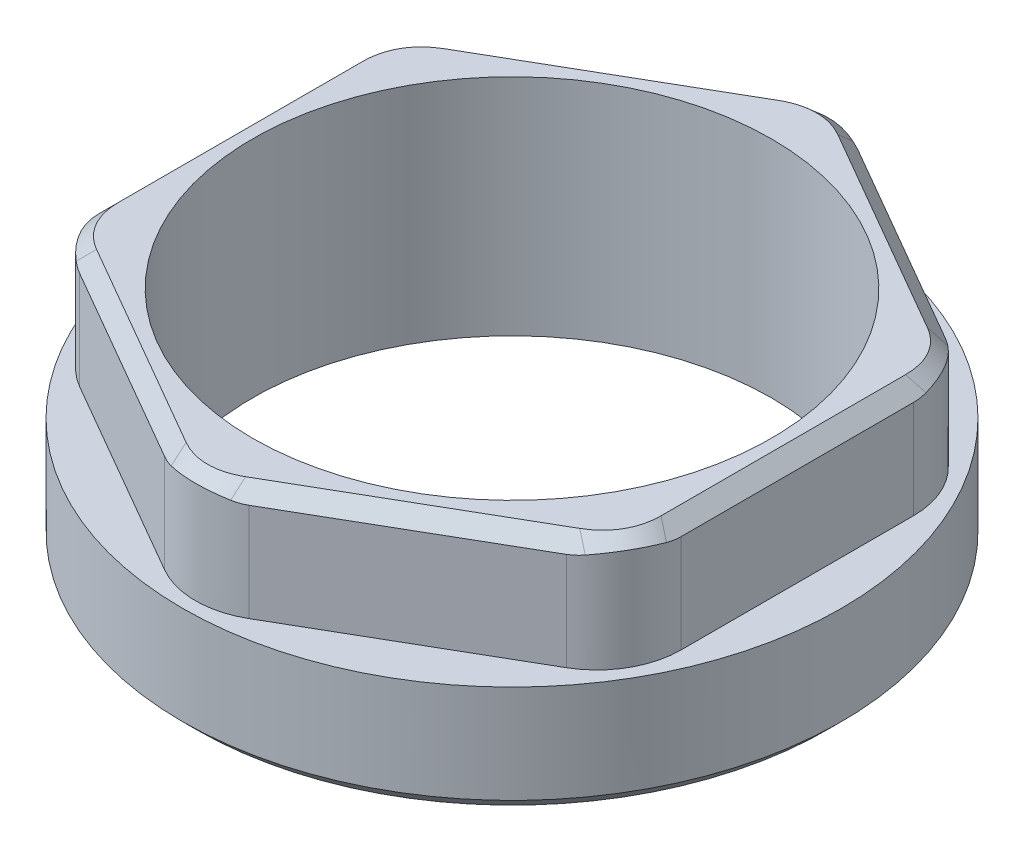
ISO-10303-21;
HEADER;
FILE_DESCRIPTION(('STEP AP214'),'2;1');
FILE_NAME('part.step','',(''),(''),'','','');
FILE_SCHEMA(('AUTOMOTIVE_DESIGN { 1 0 10303 214 1 1 1 1 }'));
ENDSEC;
DATA;
#1=APPLICATION_CONTEXT('core data for automotive mechanical design processes');
#2=APPLICATION_PROTOCOL_DEFINITION('international standard','automotive_design',2000,#1);
#3=PRODUCT_CONTEXT('',#1,'mechanical');
#4=PRODUCT('Part','Part','',(#3));
#5=PRODUCT_RELATED_PRODUCT_CATEGORY('part','',(#4));
#6=PRODUCT_DEFINITION_FORMATION('','',#4);
#7=PRODUCT_DEFINITION_CONTEXT('part definition',#1,'design');
#8=PRODUCT_DEFINITION('design','',#6,#7);
#9=PRODUCT_DEFINITION_SHAPE('','',#8);
#10=(LENGTH_UNIT() NAMED_UNIT(*) SI_UNIT(.MILLI.,.METRE.));
#11=(NAMED_UNIT(*) PLANE_ANGLE_UNIT() SI_UNIT($,.RADIAN.));
#12=(NAMED_UNIT(*) SI_UNIT($,.STERADIAN.) SOLID_ANGLE_UNIT());
#13=UNCERTAINTY_MEASURE_WITH_UNIT(LENGTH_MEASURE(1.E-05),#10,'distance_accuracy_value','');
#14=(GEOMETRIC_REPRESENTATION_CONTEXT(3) GLOBAL_UNCERTAINTY_ASSIGNED_CONTEXT((#13)) GLOBAL_UNIT_ASSIGNED_CONTEXT((#10,
#11,#12)) REPRESENTATION_CONTEXT('',''));
#15=CARTESIAN_POINT('',(0.,0.,0.));
#16=DIRECTION('',(0.,0.,1.));
#17=DIRECTION('',(1.,0.,0.));
#18=AXIS2_PLACEMENT_3D('',#15,#16,#17);
#19=CARTESIAN_POINT('',(0.,4.,0.));
#20=DIRECTION('',(0.,1.,0.));
#21=DIRECTION('',(0.,0.,1.));
#22=AXIS2_PLACEMENT_3D('',#19,#20,#21);
#23=PLANE('',#22);
#24=CARTESIAN_POINT('',(0.,4.,0.));
#25=DIRECTION('',(0.,1.,0.));
#26=DIRECTION('',(0.,0.,1.));
#27=AXIS2_PLACEMENT_3D('',#24,#25,#26);
#28=CIRCLE('',#27,11.75);
#29=CARTESIAN_POINT('',(10.1757984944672,4.,5.87499999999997));
#30=VERTEX_POINT('',#29);
#31=CARTESIAN_POINT('',(10.1757984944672,4.,-5.87499999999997));
#32=VERTEX_POINT('',#31);
#33=EDGE_CURVE('E232',#30,#32,#28,.T.);
#34=ORIENTED_EDGE('',*,*,#33,.T.);
#35=CARTESIAN_POINT('',(0.,4.,-11.75));
#36=VERTEX_POINT('',#35);
#37=EDGE_CURVE('E220',#32,#36,#28,.T.);
#38=ORIENTED_EDGE('',*,*,#37,.T.);
#39=CARTESIAN_POINT('',(-10.1757984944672,4.,-5.87499999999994));
#40=VERTEX_POINT('',#39);
#41=EDGE_CURVE('E215',#36,#40,#28,.T.);
#42=ORIENTED_EDGE('',*,*,#41,.T.);
#43=CARTESIAN_POINT('',(-10.1757984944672,4.,5.87499999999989));
#44=VERTEX_POINT('',#43);
#45=EDGE_CURVE('E219',#40,#44,#28,.T.);
#46=ORIENTED_EDGE('',*,*,#45,.T.);
#47=CARTESIAN_POINT('',(0.,4.,11.75));
#48=VERTEX_POINT('',#47);
#49=EDGE_CURVE('E225',#44,#48,#28,.T.);
#50=ORIENTED_EDGE('',*,*,#49,.T.);
#51=EDGE_CURVE('E227',#48,#30,#28,.T.);
#52=ORIENTED_EDGE('',*,*,#51,.T.);
#53=EDGE_LOOP('',(#34,#38,#42,#46,#50,#52));
#54=FACE_BOUND('',#53,.T.);
#55=DIRECTION('',(0.,0.,-1.));
#56=VECTOR('',#55,1.);
#57=CARTESIAN_POINT('',(10.1757984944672,4.,5.87499999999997));
#58=LINE('',#57,#56);
#59=CARTESIAN_POINT('',(10.1757984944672,4.,4.1429491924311));
#60=VERTEX_POINT('',#59);
#61=CARTESIAN_POINT('',(10.1757984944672,4.,-4.14294919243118));
#62=VERTEX_POINT('',#61);
#63=EDGE_CURVE('E51',#60,#62,#58,.T.);
#64=ORIENTED_EDGE('',*,*,#63,.F.);
#65=CARTESIAN_POINT('',(7.17579849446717,4.,4.1429491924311));
#66=DIRECTION('',(0.,1.,0.));
#67=DIRECTION('',(0.,0.,1.));
#68=AXIS2_PLACEMENT_3D('',#65,#66,#67);
#69=CIRCLE('',#68,3.);
#70=CARTESIAN_POINT('',(8.67579849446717,4.,6.74102540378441));
#71=VERTEX_POINT('',#70);
#72=EDGE_CURVE('E43',#60,#71,#69,.F.);
#73=ORIENTED_EDGE('',*,*,#72,.T.);
#74=DIRECTION('',(0.866025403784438,0.,-0.500000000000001));
#75=VECTOR('',#74,1.);
#76=CARTESIAN_POINT('',(0.,4.,11.75));
#77=LINE('',#76,#75);
#78=CARTESIAN_POINT('',(1.49999999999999,4.,10.8839745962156));
#79=VERTEX_POINT('',#78);
#80=EDGE_CURVE('E58',#79,#71,#77,.T.);
#81=ORIENTED_EDGE('',*,*,#80,.F.);
#82=CARTESIAN_POINT('',(0.,4.,8.28589838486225));
#83=DIRECTION('',(0.,1.,0.));
#84=DIRECTION('',(0.,0.,1.));
#85=AXIS2_PLACEMENT_3D('',#82,#83,#84);
#86=CIRCLE('',#85,3.);
#87=CARTESIAN_POINT('',(-1.49999999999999,4.,10.8839745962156));
#88=VERTEX_POINT('',#87);
#89=EDGE_CURVE('E364',#79,#88,#86,.F.);
#90=ORIENTED_EDGE('',*,*,#89,.T.);
#91=DIRECTION('',(0.866025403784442,0.,0.499999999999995));
#92=VECTOR('',#91,1.);
#93=CARTESIAN_POINT('',(-10.1757984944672,4.,5.87500000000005));
#94=LINE('',#93,#92);
#95=CARTESIAN_POINT('',(-8.6757984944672,4.,6.74102540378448));
#96=VERTEX_POINT('',#95);
#97=EDGE_CURVE('E479',#96,#88,#94,.T.);
#98=ORIENTED_EDGE('',*,*,#97,.F.);
#99=CARTESIAN_POINT('',(-7.17579849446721,4.,4.14294919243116));
#100=DIRECTION('',(0.,1.,0.));
#101=DIRECTION('',(0.,0.,1.));
#102=AXIS2_PLACEMENT_3D('',#99,#100,#101);
#103=CIRCLE('',#102,3.);
#104=CARTESIAN_POINT('',(-10.1757984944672,4.,4.14294919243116));
#105=VERTEX_POINT('',#104);
#106=EDGE_CURVE('E367',#96,#105,#103,.F.);
#107=ORIENTED_EDGE('',*,*,#106,.T.);
#108=DIRECTION('',(0.,0.,1.));
#109=VECTOR('',#108,1.);
#110=CARTESIAN_POINT('',(-10.1757984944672,4.,-5.87499999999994));
#111=LINE('',#110,#109);
#112=CARTESIAN_POINT('',(-10.1757984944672,4.,-4.14294919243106));
#113=VERTEX_POINT('',#112);
#114=EDGE_CURVE('E483',#113,#105,#111,.T.);
#115=ORIENTED_EDGE('',*,*,#114,.F.);
#116=CARTESIAN_POINT('',(-7.17579849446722,4.,-4.14294919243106));
#117=DIRECTION('',(0.,1.,0.));
#118=DIRECTION('',(0.,0.,1.));
#119=AXIS2_PLACEMENT_3D('',#116,#117,#118);
#120=CIRCLE('',#119,3.);
#121=CARTESIAN_POINT('',(-8.67579849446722,4.,-6.74102540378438));
#122=VERTEX_POINT('',#121);
#123=EDGE_CURVE('E370',#113,#122,#120,.F.);
#124=ORIENTED_EDGE('',*,*,#123,.T.);
#125=DIRECTION('',(-0.866025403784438,0.,0.500000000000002));
#126=VECTOR('',#125,1.);
#127=CARTESIAN_POINT('',(0.,4.,-11.75));
#128=LINE('',#127,#126);
#129=CARTESIAN_POINT('',(-1.49999999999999,4.,-10.8839745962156));
#130=VERTEX_POINT('',#129);
#131=EDGE_CURVE('E485',#130,#122,#128,.T.);
#132=ORIENTED_EDGE('',*,*,#131,.F.);
#133=CARTESIAN_POINT('',(0.,4.,-8.28589838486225));
#134=DIRECTION('',(0.,1.,0.));
#135=DIRECTION('',(0.,0.,1.));
#136=AXIS2_PLACEMENT_3D('',#133,#134,#135);
#137=CIRCLE('',#136,3.);
#138=CARTESIAN_POINT('',(1.5,4.,-10.8839745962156));
#139=VERTEX_POINT('',#138);
#140=EDGE_CURVE('E373',#130,#139,#137,.F.);
#141=ORIENTED_EDGE('',*,*,#140,.T.);
#142=DIRECTION('',(-0.866025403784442,0.,-0.499999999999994));
#143=VECTOR('',#142,1.);
#144=CARTESIAN_POINT('',(10.1757984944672,4.,-5.87500000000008));
#145=LINE('',#144,#143);
#146=CARTESIAN_POINT('',(8.67579849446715,4.,-6.74102540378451));
#147=VERTEX_POINT('',#146);
#148=EDGE_CURVE('E487',#147,#139,#145,.T.);
#149=ORIENTED_EDGE('',*,*,#148,.F.);
#150=CARTESIAN_POINT('',(7.17579849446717,4.,-4.14294919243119));
#151=DIRECTION('',(0.,1.,0.));
#152=DIRECTION('',(0.,0.,1.));
#153=AXIS2_PLACEMENT_3D('',#150,#151,#152);
#154=CIRCLE('',#153,3.);
#155=EDGE_CURVE('E11',#147,#62,#154,.F.);
#156=ORIENTED_EDGE('',*,*,#155,.T.);
#157=EDGE_LOOP('',(#64,#73,#81,#90,#98,#107,#115,#124,#132,#141,#149,#156));
#158=FACE_BOUND('',#157,.T.);
#159=ADVANCED_FACE('F34',(#54,#158),#23,.T.);
#160=CARTESIAN_POINT('',(0.,0.,0.));
#161=DIRECTION('',(0.,1.,0.));
#162=DIRECTION('',(0.,0.,1.));
#163=AXIS2_PLACEMENT_3D('',#160,#161,#162);
#164=PLANE('',#163);
#165=CARTESIAN_POINT('',(0.,0.,0.));
#166=DIRECTION('',(0.,1.,0.));
#167=DIRECTION('',(0.,0.,1.));
#168=AXIS2_PLACEMENT_3D('',#165,#166,#167);
#169=CIRCLE('',#168,11.25);
#170=CARTESIAN_POINT('',(0.,0.,11.25));
#171=VERTEX_POINT('',#170);
#172=EDGE_CURVE('E236',#171,#171,#169,.F.);
#173=ORIENTED_EDGE('',*,*,#172,.T.);
#174=EDGE_LOOP('',(#173));
#175=FACE_BOUND('',#174,.T.);
#176=CARTESIAN_POINT('',(0.,0.,0.));
#177=DIRECTION('',(0.,1.,0.));
#178=DIRECTION('',(0.,0.,1.));
#179=AXIS2_PLACEMENT_3D('',#176,#177,#178);
#180=CIRCLE('',#179,9.25);
#181=CARTESIAN_POINT('',(0.,0.,9.25));
#182=VERTEX_POINT('',#181);
#183=EDGE_CURVE('E226',#182,#182,#180,.T.);
#184=ORIENTED_EDGE('',*,*,#183,.T.);
#185=EDGE_LOOP('',(#184));
#186=FACE_BOUND('',#185,.T.);
#187=ADVANCED_FACE('F507',(#175,#186),#164,.F.);
#188=CARTESIAN_POINT('',(0.,4.,0.));
#189=DIRECTION('',(0.,-1.,0.));
#190=DIRECTION('',(0.,0.,-1.));
#191=AXIS2_PLACEMENT_3D('',#188,#189,#190);
#192=CYLINDRICAL_SURFACE('',#191,11.75);
#193=CARTESIAN_POINT('',(0.,0.499999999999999,0.));
#194=DIRECTION('',(0.,1.,0.));
#195=DIRECTION('',(0.,0.,1.));
#196=AXIS2_PLACEMENT_3D('',#193,#194,#195);
#197=CIRCLE('',#196,11.75);
#198=CARTESIAN_POINT('',(0.,0.499999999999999,11.75));
#199=VERTEX_POINT('',#198);
#200=EDGE_CURVE('E231',#199,#199,#197,.T.);
#201=ORIENTED_EDGE('',*,*,#200,.T.);
#202=EDGE_LOOP('',(#201));
#203=FACE_BOUND('',#202,.T.);
#204=ORIENTED_EDGE('',*,*,#51,.F.);
#205=ORIENTED_EDGE('',*,*,#49,.F.);
#206=ORIENTED_EDGE('',*,*,#45,.F.);
#207=ORIENTED_EDGE('',*,*,#41,.F.);
#208=ORIENTED_EDGE('',*,*,#37,.F.);
#209=ORIENTED_EDGE('',*,*,#33,.F.);
#210=EDGE_LOOP('',(#204,#205,#206,#207,#208,#209));
#211=FACE_BOUND('',#210,.T.);
#212=ADVANCED_FACE('F224',(#203,#211),#192,.T.);
#213=CARTESIAN_POINT('',(0.,4.,0.));
#214=DIRECTION('',(0.,-1.,0.));
#215=DIRECTION('',(0.,0.,-1.));
#216=AXIS2_PLACEMENT_3D('',#213,#214,#215);
#217=CYLINDRICAL_SURFACE('',#216,9.25);
#218=ORIENTED_EDGE('',*,*,#183,.F.);
#219=EDGE_LOOP('',(#218));
#220=FACE_BOUND('',#219,.T.);
#221=CARTESIAN_POINT('',(0.,8.,0.));
#222=DIRECTION('',(0.,1.,0.));
#223=DIRECTION('',(0.,0.,1.));
#224=AXIS2_PLACEMENT_3D('',#221,#222,#223);
#225=CIRCLE('',#224,9.25);
#226=CARTESIAN_POINT('',(0.,8.,9.25));
#227=VERTEX_POINT('',#226);
#228=EDGE_CURVE('E380',#227,#227,#225,.T.);
#229=ORIENTED_EDGE('',*,*,#228,.T.);
#230=EDGE_LOOP('',(#229));
#231=FACE_BOUND('',#230,.T.);
#232=ADVANCED_FACE('F492',(#220,#231),#217,.F.);
#233=CARTESIAN_POINT('',(0.,8.,0.));
#234=DIRECTION('',(0.,1.,0.));
#235=DIRECTION('',(0.,0.,1.));
#236=AXIS2_PLACEMENT_3D('',#233,#234,#235);
#237=PLANE('',#236);
#238=DIRECTION('',(0.866025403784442,0.,0.499999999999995));
#239=VECTOR('',#238,1.);
#240=CARTESIAN_POINT('',(0.249999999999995,8.,11.3169872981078));
#241=LINE('',#240,#239);
#242=CARTESIAN_POINT('',(-8.61513832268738,8.,6.19869730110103));
#243=VERTEX_POINT('',#242);
#244=CARTESIAN_POINT('',(-1.06066017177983,8.,10.5602772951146));
#245=VERTEX_POINT('',#244);
#246=EDGE_CURVE('E239',#243,#245,#241,.T.);
#247=ORIENTED_EDGE('',*,*,#246,.T.);
#248=CARTESIAN_POINT('',(0.,8.,6.27367024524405));
#249=DIRECTION('',(0.,1.,0.));
#250=DIRECTION('',(0.,0.,-1.));
#251=AXIS2_PLACEMENT_3D('',#248,#249,#250);
#252=ELLIPSE('',#251,4.58257569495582,3.);
#253=CARTESIAN_POINT('',(1.06066017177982,8.,10.5602772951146));
#254=VERTEX_POINT('',#253);
#255=EDGE_CURVE('E294',#245,#254,#252,.T.);
#256=ORIENTED_EDGE('',*,*,#255,.T.);
#257=DIRECTION('',(0.866025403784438,0.,-0.500000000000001));
#258=VECTOR('',#257,1.);
#259=CARTESIAN_POINT('',(9.92579849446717,8.,5.44198729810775));
#260=LINE('',#259,#258);
#261=CARTESIAN_POINT('',(8.61513832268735,8.,6.19869730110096));
#262=VERTEX_POINT('',#261);
#263=EDGE_CURVE('E242',#254,#262,#260,.T.);
#264=ORIENTED_EDGE('',*,*,#263,.T.);
#265=CARTESIAN_POINT('',(5.4331578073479,8.,3.13683512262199));
#266=DIRECTION('',(0.,1.,0.));
#267=DIRECTION('',(-0.866025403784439,0.,-0.5));
#268=AXIS2_PLACEMENT_3D('',#265,#266,#267);
#269=ELLIPSE('',#268,4.58257569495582,3.);
#270=CARTESIAN_POINT('',(9.67579849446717,8.,4.36157999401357));
#271=VERTEX_POINT('',#270);
#272=EDGE_CURVE('E286',#262,#271,#269,.T.);
#273=ORIENTED_EDGE('',*,*,#272,.T.);
#274=DIRECTION('',(0.,0.,-1.));
#275=VECTOR('',#274,1.);
#276=CARTESIAN_POINT('',(9.67579849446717,8.,-5.87500000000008));
#277=LINE('',#276,#275);
#278=CARTESIAN_POINT('',(9.67579849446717,8.,-4.36157999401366));
#279=VERTEX_POINT('',#278);
#280=EDGE_CURVE('E245',#271,#279,#277,.T.);
#281=ORIENTED_EDGE('',*,*,#280,.T.);
#282=CARTESIAN_POINT('',(5.4331578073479,8.,-3.13683512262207));
#283=DIRECTION('',(0.,1.,0.));
#284=DIRECTION('',(0.866025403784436,0.,-0.500000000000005));
#285=AXIS2_PLACEMENT_3D('',#282,#283,#284);
#286=ELLIPSE('',#285,4.58257569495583,3.);
#287=CARTESIAN_POINT('',(8.61513832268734,8.,-6.19869730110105));
#288=VERTEX_POINT('',#287);
#289=EDGE_CURVE('E284',#279,#288,#286,.T.);
#290=ORIENTED_EDGE('',*,*,#289,.T.);
#291=DIRECTION('',(-0.866025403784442,0.,-0.499999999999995));
#292=VECTOR('',#291,1.);
#293=CARTESIAN_POINT('',(-0.249999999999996,8.,-11.3169872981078));
#294=LINE('',#293,#292);
#295=CARTESIAN_POINT('',(1.06066017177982,8.,-10.5602772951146));
#296=VERTEX_POINT('',#295);
#297=EDGE_CURVE('E248',#288,#296,#294,.T.);
#298=ORIENTED_EDGE('',*,*,#297,.T.);
#299=CARTESIAN_POINT('',(0.,8.,-6.27367024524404));
#300=DIRECTION('',(0.,1.,0.));
#301=DIRECTION('',(0.,0.,-1.));
#302=AXIS2_PLACEMENT_3D('',#299,#300,#301);
#303=ELLIPSE('',#302,4.58257569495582,3.);
#304=CARTESIAN_POINT('',(-1.06066017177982,8.,-10.5602772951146));
#305=VERTEX_POINT('',#304);
#306=EDGE_CURVE('E288',#296,#305,#303,.T.);
#307=ORIENTED_EDGE('',*,*,#306,.T.);
#308=DIRECTION('',(-0.866025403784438,0.,0.500000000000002));
#309=VECTOR('',#308,1.);
#310=CARTESIAN_POINT('',(-9.92579849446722,8.,-5.44198729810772));
#311=LINE('',#310,#309);
#312=CARTESIAN_POINT('',(-8.6151383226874,8.,-6.19869730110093));
#313=VERTEX_POINT('',#312);
#314=EDGE_CURVE('E251',#305,#313,#311,.T.);
#315=ORIENTED_EDGE('',*,*,#314,.T.);
#316=CARTESIAN_POINT('',(-5.43315780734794,8.,-3.13683512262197));
#317=DIRECTION('',(0.,1.,0.));
#318=DIRECTION('',(-0.866025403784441,0.,-0.499999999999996));
#319=AXIS2_PLACEMENT_3D('',#316,#317,#318);
#320=ELLIPSE('',#319,4.58257569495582,3.);
#321=CARTESIAN_POINT('',(-9.67579849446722,8.,-4.36157999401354));
#322=VERTEX_POINT('',#321);
#323=EDGE_CURVE('E290',#313,#322,#320,.T.);
#324=ORIENTED_EDGE('',*,*,#323,.T.);
#325=DIRECTION('',(0.,0.,1.));
#326=VECTOR('',#325,1.);
#327=CARTESIAN_POINT('',(-9.67579849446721,8.,5.87500000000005));
#328=LINE('',#327,#326);
#329=CARTESIAN_POINT('',(-9.67579849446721,8.,4.36157999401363));
#330=VERTEX_POINT('',#329);
#331=EDGE_CURVE('E254',#322,#330,#328,.T.);
#332=ORIENTED_EDGE('',*,*,#331,.T.);
#333=CARTESIAN_POINT('',(-5.43315780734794,8.,3.13683512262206));
#334=DIRECTION('',(0.,1.,0.));
#335=DIRECTION('',(0.866025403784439,0.,-0.5));
#336=AXIS2_PLACEMENT_3D('',#333,#334,#335);
#337=ELLIPSE('',#336,4.58257569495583,3.);
#338=EDGE_CURVE('E292',#330,#243,#337,.T.);
#339=ORIENTED_EDGE('',*,*,#338,.T.);
#340=EDGE_LOOP('',(#247,#256,#264,#273,#281,#290,#298,#307,#315,#324,#332,#339));
#341=FACE_BOUND('',#340,.T.);
#342=ORIENTED_EDGE('',*,*,#228,.F.);
#343=EDGE_LOOP('',(#342));
#344=FACE_BOUND('',#343,.T.);
#345=ADVANCED_FACE('F413',(#341,#344),#237,.T.);
#346=CARTESIAN_POINT('',(10.1757984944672,8.,-5.87500000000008));
#347=DIRECTION('',(-0.499999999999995,0.,0.866025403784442));
#348=DIRECTION('',(0.866025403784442,0.,0.499999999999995));
#349=AXIS2_PLACEMENT_3D('',#346,#347,#348);
#350=PLANE('',#349);
#351=ORIENTED_EDGE('',*,*,#148,.T.);
#352=DIRECTION('',(0.,-1.,0.));
#353=VECTOR('',#352,1.);
#354=CARTESIAN_POINT('',(1.5,8.,-10.8839745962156));
#355=LINE('',#354,#353);
#356=CARTESIAN_POINT('',(1.5,7.5,-10.8839745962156));
#357=VERTEX_POINT('',#356);
#358=EDGE_CURVE('E341',#139,#357,#355,.F.);
#359=ORIENTED_EDGE('',*,*,#358,.T.);
#360=DIRECTION('',(0.866025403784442,0.,0.499999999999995));
#361=VECTOR('',#360,1.);
#362=CARTESIAN_POINT('',(10.1757984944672,7.5,-5.87500000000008));
#363=LINE('',#362,#361);
#364=CARTESIAN_POINT('',(8.67579849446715,7.5,-6.74102540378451));
#365=VERTEX_POINT('',#364);
#366=EDGE_CURVE('E263',#357,#365,#363,.T.);
#367=ORIENTED_EDGE('',*,*,#366,.T.);
#368=DIRECTION('',(0.,-1.,0.));
#369=VECTOR('',#368,1.);
#370=CARTESIAN_POINT('',(8.67579849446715,8.,-6.74102540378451));
#371=LINE('',#370,#369);
#372=EDGE_CURVE('E339',#365,#147,#371,.T.);
#373=ORIENTED_EDGE('',*,*,#372,.T.);
#374=EDGE_LOOP('',(#351,#359,#367,#373));
#375=FACE_BOUND('',#374,.T.);
#376=ADVANCED_FACE('F494',(#375),#350,.F.);
#377=CARTESIAN_POINT('',(0.,8.,-11.75));
#378=DIRECTION('',(0.500000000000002,0.,0.866025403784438));
#379=DIRECTION('',(0.866025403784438,0.,-0.500000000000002));
#380=AXIS2_PLACEMENT_3D('',#377,#378,#379);
#381=PLANE('',#380);
#382=ORIENTED_EDGE('',*,*,#131,.T.);
#383=DIRECTION('',(0.,-1.,0.));
#384=VECTOR('',#383,1.);
#385=CARTESIAN_POINT('',(-8.67579849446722,8.,-6.74102540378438));
#386=LINE('',#385,#384);
#387=CARTESIAN_POINT('',(-8.67579849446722,7.5,-6.74102540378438));
#388=VERTEX_POINT('',#387);
#389=EDGE_CURVE('E329',#122,#388,#386,.F.);
#390=ORIENTED_EDGE('',*,*,#389,.T.);
#391=DIRECTION('',(0.866025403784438,0.,-0.500000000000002));
#392=VECTOR('',#391,1.);
#393=CARTESIAN_POINT('',(0.,7.5,-11.75));
#394=LINE('',#393,#392);
#395=CARTESIAN_POINT('',(-1.49999999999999,7.5,-10.8839745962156));
#396=VERTEX_POINT('',#395);
#397=EDGE_CURVE('E260',#388,#396,#394,.T.);
#398=ORIENTED_EDGE('',*,*,#397,.T.);
#399=DIRECTION('',(0.,-1.,0.));
#400=VECTOR('',#399,1.);
#401=CARTESIAN_POINT('',(-1.49999999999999,8.,-10.8839745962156));
#402=LINE('',#401,#400);
#403=EDGE_CURVE('E326',#396,#130,#402,.T.);
#404=ORIENTED_EDGE('',*,*,#403,.T.);
#405=EDGE_LOOP('',(#382,#390,#398,#404));
#406=FACE_BOUND('',#405,.T.);
#407=ADVANCED_FACE('F500',(#406),#381,.F.);
#408=CARTESIAN_POINT('',(-10.1757984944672,8.,-5.87499999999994));
#409=DIRECTION('',(1.,0.,0.));
#410=DIRECTION('',(0.,0.,-1.));
#411=AXIS2_PLACEMENT_3D('',#408,#409,#410);
#412=PLANE('',#411);
#413=ORIENTED_EDGE('',*,*,#114,.T.);
#414=DIRECTION('',(0.,-1.,0.));
#415=VECTOR('',#414,1.);
#416=CARTESIAN_POINT('',(-10.1757984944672,8.,4.14294919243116));
#417=LINE('',#416,#415);
#418=CARTESIAN_POINT('',(-10.1757984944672,7.5,4.14294919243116));
#419=VERTEX_POINT('',#418);
#420=EDGE_CURVE('E316',#105,#419,#417,.F.);
#421=ORIENTED_EDGE('',*,*,#420,.T.);
#422=DIRECTION('',(0.,0.,-1.));
#423=VECTOR('',#422,1.);
#424=CARTESIAN_POINT('',(-10.1757984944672,7.5,-5.87499999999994));
#425=LINE('',#424,#423);
#426=CARTESIAN_POINT('',(-10.1757984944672,7.5,-4.14294919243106));
#427=VERTEX_POINT('',#426);
#428=EDGE_CURVE('E257',#419,#427,#425,.T.);
#429=ORIENTED_EDGE('',*,*,#428,.T.);
#430=DIRECTION('',(0.,-1.,0.));
#431=VECTOR('',#430,1.);
#432=CARTESIAN_POINT('',(-10.1757984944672,8.,-4.14294919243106));
#433=LINE('',#432,#431);
#434=EDGE_CURVE('E313',#427,#113,#433,.T.);
#435=ORIENTED_EDGE('',*,*,#434,.T.);
#436=EDGE_LOOP('',(#413,#421,#429,#435));
#437=FACE_BOUND('',#436,.T.);
#438=ADVANCED_FACE('F652',(#437),#412,.F.);
#439=CARTESIAN_POINT('',(-10.1757984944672,8.,5.87500000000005));
#440=DIRECTION('',(0.499999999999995,0.,-0.866025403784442));
#441=DIRECTION('',(-0.866025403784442,0.,-0.499999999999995));
#442=AXIS2_PLACEMENT_3D('',#439,#440,#441);
#443=PLANE('',#442);
#444=ORIENTED_EDGE('',*,*,#97,.T.);
#445=DIRECTION('',(0.,-1.,0.));
#446=VECTOR('',#445,1.);
#447=CARTESIAN_POINT('',(-1.49999999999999,8.,10.8839745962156));
#448=LINE('',#447,#446);
#449=CARTESIAN_POINT('',(-1.49999999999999,7.5,10.8839745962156));
#450=VERTEX_POINT('',#449);
#451=EDGE_CURVE('E311',#88,#450,#448,.F.);
#452=ORIENTED_EDGE('',*,*,#451,.T.);
#453=DIRECTION('',(-0.866025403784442,0.,-0.499999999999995));
#454=VECTOR('',#453,1.);
#455=CARTESIAN_POINT('',(-10.1757984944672,7.5,5.87500000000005));
#456=LINE('',#455,#454);
#457=CARTESIAN_POINT('',(-8.6757984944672,7.5,6.74102540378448));
#458=VERTEX_POINT('',#457);
#459=EDGE_CURVE('E272',#450,#458,#456,.T.);
#460=ORIENTED_EDGE('',*,*,#459,.T.);
#461=DIRECTION('',(0.,-1.,0.));
#462=VECTOR('',#461,1.);
#463=CARTESIAN_POINT('',(-8.6757984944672,8.,6.74102540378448));
#464=LINE('',#463,#462);
#465=EDGE_CURVE('E308',#458,#96,#464,.T.);
#466=ORIENTED_EDGE('',*,*,#465,.T.);
#467=EDGE_LOOP('',(#444,#452,#460,#466));
#468=FACE_BOUND('',#467,.T.);
#469=ADVANCED_FACE('F645',(#468),#443,.F.);
#470=CARTESIAN_POINT('',(0.,8.,11.75));
#471=DIRECTION('',(-0.500000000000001,0.,-0.866025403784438));
#472=DIRECTION('',(-0.866025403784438,0.,0.500000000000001));
#473=AXIS2_PLACEMENT_3D('',#470,#471,#472);
#474=PLANE('',#473);
#475=DIRECTION('',(-0.866025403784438,0.,0.500000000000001));
#476=VECTOR('',#475,1.);
#477=CARTESIAN_POINT('',(0.,7.5,11.75));
#478=LINE('',#477,#476);
#479=CARTESIAN_POINT('',(8.67579849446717,7.5,6.74102540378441));
#480=VERTEX_POINT('',#479);
#481=CARTESIAN_POINT('',(1.49999999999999,7.5,10.8839745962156));
#482=VERTEX_POINT('',#481);
#483=EDGE_CURVE('E269',#480,#482,#478,.T.);
#484=ORIENTED_EDGE('',*,*,#483,.T.);
#485=DIRECTION('',(0.,-1.,0.));
#486=VECTOR('',#485,1.);
#487=CARTESIAN_POINT('',(1.49999999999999,8.,10.8839745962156));
#488=LINE('',#487,#486);
#489=EDGE_CURVE('E306',#482,#79,#488,.T.);
#490=ORIENTED_EDGE('',*,*,#489,.T.);
#491=ORIENTED_EDGE('',*,*,#80,.T.);
#492=DIRECTION('',(0.,-1.,0.));
#493=VECTOR('',#492,1.);
#494=CARTESIAN_POINT('',(8.67579849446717,8.,6.74102540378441));
#495=LINE('',#494,#493);
#496=EDGE_CURVE('E304',#71,#480,#495,.F.);
#497=ORIENTED_EDGE('',*,*,#496,.T.);
#498=EDGE_LOOP('',(#484,#490,#491,#497));
#499=FACE_BOUND('',#498,.T.);
#500=ADVANCED_FACE('F464',(#499),#474,.F.);
#501=CARTESIAN_POINT('',(10.1757984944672,8.,5.87499999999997));
#502=DIRECTION('',(-1.,0.,0.));
#503=DIRECTION('',(0.,0.,1.));
#504=AXIS2_PLACEMENT_3D('',#501,#502,#503);
#505=PLANE('',#504);
#506=DIRECTION('',(0.,0.,1.));
#507=VECTOR('',#506,1.);
#508=CARTESIAN_POINT('',(10.1757984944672,7.5,5.87499999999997));
#509=LINE('',#508,#507);
#510=CARTESIAN_POINT('',(10.1757984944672,7.5,-4.14294919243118));
#511=VERTEX_POINT('',#510);
#512=CARTESIAN_POINT('',(10.1757984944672,7.5,4.1429491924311));
#513=VERTEX_POINT('',#512);
#514=EDGE_CURVE('E266',#511,#513,#509,.T.);
#515=ORIENTED_EDGE('',*,*,#514,.T.);
#516=DIRECTION('',(0.,-1.,0.));
#517=VECTOR('',#516,1.);
#518=CARTESIAN_POINT('',(10.1757984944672,8.,4.1429491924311));
#519=LINE('',#518,#517);
#520=EDGE_CURVE('E354',#513,#60,#519,.T.);
#521=ORIENTED_EDGE('',*,*,#520,.T.);
#522=ORIENTED_EDGE('',*,*,#63,.T.);
#523=DIRECTION('',(0.,-1.,0.));
#524=VECTOR('',#523,1.);
#525=CARTESIAN_POINT('',(10.1757984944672,8.,-4.14294919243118));
#526=LINE('',#525,#524);
#527=EDGE_CURVE('E352',#62,#511,#526,.F.);
#528=ORIENTED_EDGE('',*,*,#527,.T.);
#529=EDGE_LOOP('',(#515,#521,#522,#528));
#530=FACE_BOUND('',#529,.T.);
#531=ADVANCED_FACE('F476',(#530),#505,.F.);
#532=CARTESIAN_POINT('',(0.,0.499999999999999,0.));
#533=DIRECTION('',(0.,1.,0.));
#534=DIRECTION('',(0.,0.,1.));
#535=AXIS2_PLACEMENT_3D('',#532,#533,#534);
#536=CONICAL_SURFACE('',#535,11.75,0.78539816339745);
#537=ORIENTED_EDGE('',*,*,#172,.F.);
#538=EDGE_LOOP('',(#537));
#539=FACE_BOUND('',#538,.T.);
#540=ORIENTED_EDGE('',*,*,#200,.F.);
#541=EDGE_LOOP('',(#540));
#542=FACE_BOUND('',#541,.T.);
#543=ADVANCED_FACE('F518',(#539,#542),#536,.T.);
#544=CARTESIAN_POINT('',(9.67579849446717,8.,0.));
#545=DIRECTION('',(0.70710678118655,0.707106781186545,0.));
#546=DIRECTION('',(0.,0.,1.));
#547=AXIS2_PLACEMENT_3D('',#544,#545,#546);
#548=PLANE('',#547);
#549=DIRECTION('',(-0.654653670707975,0.65465367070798,-0.377964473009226));
#550=VECTOR('',#549,1.);
#551=CARTESIAN_POINT('',(8.59658733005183,9.07921116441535,3.73849713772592));
#552=LINE('',#551,#550);
#553=CARTESIAN_POINT('',(10.13640634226,7.53939215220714,4.62751205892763));
#554=VERTEX_POINT('',#553);
#555=EDGE_CURVE('E360',#271,#554,#552,.F.);
#556=ORIENTED_EDGE('',*,*,#555,.T.);
#557=CARTESIAN_POINT('',(7.17579849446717,10.5,4.1429491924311));
#558=DIRECTION('',(0.70710678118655,0.707106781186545,0.));
#559=DIRECTION('',(0.707106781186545,-0.70710678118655,0.));
#560=AXIS2_PLACEMENT_3D('',#557,#558,#559);
#561=ELLIPSE('',#560,4.2426406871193,3.);
#562=EDGE_CURVE('E362',#554,#513,#561,.T.);
#563=ORIENTED_EDGE('',*,*,#562,.T.);
#564=ORIENTED_EDGE('',*,*,#514,.F.);
#565=CARTESIAN_POINT('',(7.17579849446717,10.5,-4.14294919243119));
#566=DIRECTION('',(0.70710678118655,0.707106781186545,0.));
#567=DIRECTION('',(0.707106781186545,-0.70710678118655,0.));
#568=AXIS2_PLACEMENT_3D('',#565,#566,#567);
#569=ELLIPSE('',#568,4.2426406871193,3.);
#570=CARTESIAN_POINT('',(10.13640634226,7.53939215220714,-4.62751205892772));
#571=VERTEX_POINT('',#570);
#572=EDGE_CURVE('E356',#511,#571,#569,.T.);
#573=ORIENTED_EDGE('',*,*,#572,.T.);
#574=DIRECTION('',(0.654653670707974,-0.654653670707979,-0.377964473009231));
#575=VECTOR('',#574,1.);
#576=CARTESIAN_POINT('',(8.59658733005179,9.07921116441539,-3.73849713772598));
#577=LINE('',#576,#575);
#578=EDGE_CURVE('E358',#571,#279,#577,.F.);
#579=ORIENTED_EDGE('',*,*,#578,.T.);
#580=ORIENTED_EDGE('',*,*,#280,.F.);
#581=EDGE_LOOP('',(#556,#563,#564,#573,#579,#580));
#582=FACE_BOUND('',#581,.T.);
#583=ADVANCED_FACE('F473',(#582),#548,.T.);
#584=CARTESIAN_POINT('',(4.83789924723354,8.,-8.37948729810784));
#585=DIRECTION('',(0.353553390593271,0.707106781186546,-0.612372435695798));
#586=DIRECTION('',(0.866025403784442,0.,0.499999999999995));
#587=AXIS2_PLACEMENT_3D('',#584,#585,#586);
#588=PLANE('',#587);
#589=ORIENTED_EDGE('',*,*,#366,.F.);
#590=CARTESIAN_POINT('',(0.,10.5,-8.28589838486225));
#591=DIRECTION('',(0.353553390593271,0.707106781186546,-0.612372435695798));
#592=DIRECTION('',(0.353553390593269,-0.707106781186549,-0.612372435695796));
#593=AXIS2_PLACEMENT_3D('',#590,#591,#592);
#594=ELLIPSE('',#593,4.24264068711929,3.);
#595=CARTESIAN_POINT('',(1.06066017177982,7.53939215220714,-11.0921414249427));
#596=VERTEX_POINT('',#595);
#597=EDGE_CURVE('E350',#357,#596,#594,.T.);
#598=ORIENTED_EDGE('',*,*,#597,.T.);
#599=DIRECTION('',(0.,-0.65465367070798,-0.755928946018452));
#600=VECTOR('',#599,1.);
#601=CARTESIAN_POINT('',(1.06066017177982,9.07921116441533,-9.31411158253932));
#602=LINE('',#601,#600);
#603=EDGE_CURVE('E348',#596,#296,#602,.F.);
#604=ORIENTED_EDGE('',*,*,#603,.T.);
#605=ORIENTED_EDGE('',*,*,#297,.F.);
#606=DIRECTION('',(0.654653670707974,-0.654653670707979,-0.377964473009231));
#607=VECTOR('',#606,1.);
#608=CARTESIAN_POINT('',(7.53592715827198,9.07921116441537,-5.57561444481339));
#609=LINE('',#608,#607);
#610=CARTESIAN_POINT('',(9.07574617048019,7.53939215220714,-6.46462936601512));
#611=VERTEX_POINT('',#610);
#612=EDGE_CURVE('E345',#288,#611,#609,.T.);
#613=ORIENTED_EDGE('',*,*,#612,.T.);
#614=CARTESIAN_POINT('',(7.17579849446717,10.5,-4.14294919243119));
#615=DIRECTION('',(0.353553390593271,0.707106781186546,-0.612372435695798));
#616=DIRECTION('',(0.353553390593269,-0.707106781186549,-0.612372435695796));
#617=AXIS2_PLACEMENT_3D('',#614,#615,#616);
#618=ELLIPSE('',#617,4.24264068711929,3.);
#619=EDGE_CURVE('E343',#611,#365,#618,.T.);
#620=ORIENTED_EDGE('',*,*,#619,.T.);
#621=EDGE_LOOP('',(#589,#598,#604,#605,#613,#620));
#622=FACE_BOUND('',#621,.T.);
#623=ADVANCED_FACE('F409',(#622),#588,.T.);
#624=CARTESIAN_POINT('',(4.83789924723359,8.,8.37948729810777));
#625=DIRECTION('',(0.353553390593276,0.707106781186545,0.612372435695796));
#626=DIRECTION('',(-0.866025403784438,0.,0.500000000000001));
#627=AXIS2_PLACEMENT_3D('',#624,#625,#626);
#628=PLANE('',#627);
#629=ORIENTED_EDGE('',*,*,#263,.F.);
#630=DIRECTION('',(0.,0.654653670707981,-0.755928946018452));
#631=VECTOR('',#630,1.);
#632=CARTESIAN_POINT('',(1.06066017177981,9.07921116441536,9.31411158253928));
#633=LINE('',#632,#631);
#634=CARTESIAN_POINT('',(1.06066017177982,7.53939215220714,11.0921414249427));
#635=VERTEX_POINT('',#634);
#636=EDGE_CURVE('E302',#254,#635,#633,.F.);
#637=ORIENTED_EDGE('',*,*,#636,.T.);
#638=CARTESIAN_POINT('',(0.,10.5,8.28589838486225));
#639=DIRECTION('',(0.353553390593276,0.707106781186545,0.612372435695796));
#640=DIRECTION('',(0.353553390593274,-0.70710678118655,0.612372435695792));
#641=AXIS2_PLACEMENT_3D('',#638,#639,#640);
#642=ELLIPSE('',#641,4.2426406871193,3.);
#643=EDGE_CURVE('E300',#635,#482,#642,.T.);
#644=ORIENTED_EDGE('',*,*,#643,.T.);
#645=ORIENTED_EDGE('',*,*,#483,.F.);
#646=CARTESIAN_POINT('',(7.17579849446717,10.5,4.1429491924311));
#647=DIRECTION('',(0.353553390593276,0.707106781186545,0.612372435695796));
#648=DIRECTION('',(0.353553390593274,-0.70710678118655,0.612372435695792));
#649=AXIS2_PLACEMENT_3D('',#646,#647,#648);
#650=ELLIPSE('',#649,4.2426406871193,3.);
#651=CARTESIAN_POINT('',(9.0757461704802,7.53939215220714,6.46462936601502));
#652=VERTEX_POINT('',#651);
#653=EDGE_CURVE('E298',#480,#652,#650,.T.);
#654=ORIENTED_EDGE('',*,*,#653,.T.);
#655=DIRECTION('',(-0.654653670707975,0.65465367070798,-0.377964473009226));
#656=VECTOR('',#655,1.);
#657=CARTESIAN_POINT('',(7.535927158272,9.07921116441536,5.5756144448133));
#658=LINE('',#657,#656);
#659=EDGE_CURVE('E296',#652,#262,#658,.T.);
#660=ORIENTED_EDGE('',*,*,#659,.T.);
#661=EDGE_LOOP('',(#629,#637,#644,#645,#654,#660));
#662=FACE_BOUND('',#661,.T.);
#663=ADVANCED_FACE('F452',(#662),#628,.T.);
#664=CARTESIAN_POINT('',(-4.83789924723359,8.,-8.37948729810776));
#665=DIRECTION('',(-0.353553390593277,0.707106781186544,-0.612372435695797));
#666=DIRECTION('',(0.866025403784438,0.,-0.500000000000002));
#667=AXIS2_PLACEMENT_3D('',#664,#665,#666);
#668=PLANE('',#667);
#669=ORIENTED_EDGE('',*,*,#397,.F.);
#670=CARTESIAN_POINT('',(-7.17579849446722,10.5,-4.14294919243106));
#671=DIRECTION('',(-0.353553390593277,0.707106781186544,-0.612372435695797));
#672=DIRECTION('',(-0.353553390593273,-0.707106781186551,-0.612372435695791));
#673=AXIS2_PLACEMENT_3D('',#670,#671,#672);
#674=ELLIPSE('',#673,4.24264068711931,3.);
#675=CARTESIAN_POINT('',(-9.07574617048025,7.53939215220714,-6.46462936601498));
#676=VERTEX_POINT('',#675);
#677=EDGE_CURVE('E337',#388,#676,#674,.T.);
#678=ORIENTED_EDGE('',*,*,#677,.T.);
#679=DIRECTION('',(-0.654653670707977,-0.65465367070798,-0.377964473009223));
#680=VECTOR('',#679,1.);
#681=CARTESIAN_POINT('',(-7.53592715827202,9.07921116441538,-5.57561444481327));
#682=LINE('',#681,#680);
#683=EDGE_CURVE('E335',#676,#313,#682,.F.);
#684=ORIENTED_EDGE('',*,*,#683,.T.);
#685=ORIENTED_EDGE('',*,*,#314,.F.);
#686=DIRECTION('',(0.,-0.65465367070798,-0.755928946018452));
#687=VECTOR('',#686,1.);
#688=CARTESIAN_POINT('',(-1.06066017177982,9.07921116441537,-9.31411158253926));
#689=LINE('',#688,#687);
#690=CARTESIAN_POINT('',(-1.06066017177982,7.53939215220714,-11.0921414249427));
#691=VERTEX_POINT('',#690);
#692=EDGE_CURVE('E331',#305,#691,#689,.T.);
#693=ORIENTED_EDGE('',*,*,#692,.T.);
#694=CARTESIAN_POINT('',(0.,10.5,-8.28589838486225));
#695=DIRECTION('',(-0.353553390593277,0.707106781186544,-0.612372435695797));
#696=DIRECTION('',(-0.353553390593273,-0.707106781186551,-0.612372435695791));
#697=AXIS2_PLACEMENT_3D('',#694,#695,#696);
#698=ELLIPSE('',#697,4.24264068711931,3.);
#699=EDGE_CURVE('E333',#691,#396,#698,.T.);
#700=ORIENTED_EDGE('',*,*,#699,.T.);
#701=EDGE_LOOP('',(#669,#678,#684,#685,#693,#700));
#702=FACE_BOUND('',#701,.T.);
#703=ADVANCED_FACE('F423',(#702),#668,.T.);
#704=CARTESIAN_POINT('',(-4.83789924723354,8.,8.37948729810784));
#705=DIRECTION('',(-0.353553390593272,0.707106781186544,0.612372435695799));
#706=DIRECTION('',(-0.866025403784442,0.,-0.499999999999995));
#707=AXIS2_PLACEMENT_3D('',#704,#705,#706);
#708=PLANE('',#707);
#709=CARTESIAN_POINT('',(0.,10.5,8.28589838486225));
#710=DIRECTION('',(-0.353553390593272,0.707106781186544,0.612372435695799));
#711=DIRECTION('',(-0.353553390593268,-0.707106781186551,0.612372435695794));
#712=AXIS2_PLACEMENT_3D('',#709,#710,#711);
#713=ELLIPSE('',#712,4.2426406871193,3.);
#714=CARTESIAN_POINT('',(-1.06066017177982,7.53939215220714,11.0921414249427));
#715=VERTEX_POINT('',#714);
#716=EDGE_CURVE('E279',#450,#715,#713,.T.);
#717=ORIENTED_EDGE('',*,*,#716,.T.);
#718=DIRECTION('',(0.,0.65465367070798,-0.755928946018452));
#719=VECTOR('',#718,1.);
#720=CARTESIAN_POINT('',(-1.06066017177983,9.07921116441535,9.3141115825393));
#721=LINE('',#720,#719);
#722=EDGE_CURVE('E281',#715,#245,#721,.T.);
#723=ORIENTED_EDGE('',*,*,#722,.T.);
#724=ORIENTED_EDGE('',*,*,#246,.F.);
#725=DIRECTION('',(0.654653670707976,0.654653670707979,-0.377964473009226));
#726=VECTOR('',#725,1.);
#727=CARTESIAN_POINT('',(-7.53592715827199,9.07921116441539,5.57561444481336));
#728=LINE('',#727,#726);
#729=CARTESIAN_POINT('',(-9.07574617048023,7.53939215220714,6.46462936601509));
#730=VERTEX_POINT('',#729);
#731=EDGE_CURVE('E275',#243,#730,#728,.F.);
#732=ORIENTED_EDGE('',*,*,#731,.T.);
#733=CARTESIAN_POINT('',(-7.17579849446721,10.5,4.14294919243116));
#734=DIRECTION('',(-0.353553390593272,0.707106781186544,0.612372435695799));
#735=DIRECTION('',(-0.353553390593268,-0.707106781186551,0.612372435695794));
#736=AXIS2_PLACEMENT_3D('',#733,#734,#735);
#737=ELLIPSE('',#736,4.2426406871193,3.);
#738=EDGE_CURVE('E277',#730,#458,#737,.T.);
#739=ORIENTED_EDGE('',*,*,#738,.T.);
#740=ORIENTED_EDGE('',*,*,#459,.F.);
#741=EDGE_LOOP('',(#717,#723,#724,#732,#739,#740));
#742=FACE_BOUND('',#741,.T.);
#743=ADVANCED_FACE('F444',(#742),#708,.T.);
#744=CARTESIAN_POINT('',(-9.67579849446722,8.,0.));
#745=DIRECTION('',(-0.707106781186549,0.707106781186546,0.));
#746=DIRECTION('',(0.,0.,-1.));
#747=AXIS2_PLACEMENT_3D('',#744,#745,#746);
#748=PLANE('',#747);
#749=ORIENTED_EDGE('',*,*,#428,.F.);
#750=CARTESIAN_POINT('',(-7.17579849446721,10.5,4.14294919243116));
#751=DIRECTION('',(-0.707106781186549,0.707106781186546,0.));
#752=DIRECTION('',(-0.707106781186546,-0.707106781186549,0.));
#753=AXIS2_PLACEMENT_3D('',#750,#751,#752);
#754=ELLIPSE('',#753,4.2426406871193,3.);
#755=CARTESIAN_POINT('',(-10.1364063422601,7.53939215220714,4.6275120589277));
#756=VERTEX_POINT('',#755);
#757=EDGE_CURVE('E324',#419,#756,#754,.T.);
#758=ORIENTED_EDGE('',*,*,#757,.T.);
#759=DIRECTION('',(0.654653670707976,0.654653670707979,-0.377964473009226));
#760=VECTOR('',#759,1.);
#761=CARTESIAN_POINT('',(-8.59658733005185,9.07921116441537,3.73849713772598));
#762=LINE('',#761,#760);
#763=EDGE_CURVE('E322',#756,#330,#762,.T.);
#764=ORIENTED_EDGE('',*,*,#763,.T.);
#765=ORIENTED_EDGE('',*,*,#331,.F.);
#766=DIRECTION('',(-0.654653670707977,-0.65465367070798,-0.377964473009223));
#767=VECTOR('',#766,1.);
#768=CARTESIAN_POINT('',(-8.59658733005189,9.07921116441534,-3.7384971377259));
#769=LINE('',#768,#767);
#770=CARTESIAN_POINT('',(-10.1364063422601,7.53939215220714,-4.62751205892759));
#771=VERTEX_POINT('',#770);
#772=EDGE_CURVE('E318',#322,#771,#769,.T.);
#773=ORIENTED_EDGE('',*,*,#772,.T.);
#774=CARTESIAN_POINT('',(-7.17579849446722,10.5,-4.14294919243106));
#775=DIRECTION('',(-0.707106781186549,0.707106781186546,0.));
#776=DIRECTION('',(-0.707106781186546,-0.707106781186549,0.));
#777=AXIS2_PLACEMENT_3D('',#774,#775,#776);
#778=ELLIPSE('',#777,4.2426406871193,3.);
#779=EDGE_CURVE('E320',#771,#427,#778,.T.);
#780=ORIENTED_EDGE('',*,*,#779,.T.);
#781=EDGE_LOOP('',(#749,#758,#764,#765,#773,#780));
#782=FACE_BOUND('',#781,.T.);
#783=ADVANCED_FACE('F434',(#782),#748,.T.);
#784=CARTESIAN_POINT('',(0.,8.,8.28589838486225));
#785=DIRECTION('',(0.,-1.,0.));
#786=DIRECTION('',(0.,0.,-1.));
#787=AXIS2_PLACEMENT_3D('',#784,#785,#786);
#788=CYLINDRICAL_SURFACE('',#787,3.);
#789=ORIENTED_EDGE('',*,*,#489,.F.);
#790=ORIENTED_EDGE('',*,*,#643,.F.);
#791=CARTESIAN_POINT('',(0.,6.25735931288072,8.28589838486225));
#792=DIRECTION('',(0.,-0.909575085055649,0.415539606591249));
#793=DIRECTION('',(0.,-0.415539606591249,-0.909575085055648));
#794=AXIS2_PLACEMENT_3D('',#791,#792,#793);
#795=ELLIPSE('',#794,3.29824337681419,3.);
#796=EDGE_CURVE('E377',#715,#635,#795,.F.);
#797=ORIENTED_EDGE('',*,*,#796,.F.);
#798=ORIENTED_EDGE('',*,*,#716,.F.);
#799=ORIENTED_EDGE('',*,*,#451,.F.);
#800=ORIENTED_EDGE('',*,*,#89,.F.);
#801=EDGE_LOOP('',(#789,#790,#797,#798,#799,#800));
#802=FACE_BOUND('',#801,.T.);
#803=ADVANCED_FACE('F460',(#802),#788,.T.);
#804=CARTESIAN_POINT('',(0.,6.95789082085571,7.47699427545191));
#805=DIRECTION('',(0.,0.65465367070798,-0.755928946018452));
#806=DIRECTION('',(0.,0.755928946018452,0.65465367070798));
#807=AXIS2_PLACEMENT_3D('',#804,#805,#806);
#808=CYLINDRICAL_SURFACE('',#807,3.);
#809=ORIENTED_EDGE('',*,*,#796,.T.);
#810=ORIENTED_EDGE('',*,*,#636,.F.);
#811=ORIENTED_EDGE('',*,*,#255,.F.);
#812=ORIENTED_EDGE('',*,*,#722,.F.);
#813=EDGE_LOOP('',(#809,#810,#811,#812));
#814=FACE_BOUND('',#813,.T.);
#815=ADVANCED_FACE('F455',(#814),#808,.T.);
#816=CARTESIAN_POINT('',(-6.4752669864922,6.95789082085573,3.73849713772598));
#817=DIRECTION('',(0.654653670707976,0.654653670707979,-0.377964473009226));
#818=DIRECTION('',(-0.707106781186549,0.707106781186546,0.));
#819=AXIS2_PLACEMENT_3D('',#816,#817,#818);
#820=CYLINDRICAL_SURFACE('',#819,3.);
#821=ORIENTED_EDGE('',*,*,#338,.F.);
#822=ORIENTED_EDGE('',*,*,#763,.F.);
#823=CARTESIAN_POINT('',(-7.17579849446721,6.25735931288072,4.14294919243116));
#824=DIRECTION('',(0.359867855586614,0.909575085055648,-0.207769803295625));
#825=DIRECTION('',(0.787715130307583,-0.41553960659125,-0.454787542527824));
#826=AXIS2_PLACEMENT_3D('',#823,#824,#825);
#827=ELLIPSE('',#826,3.2982433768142,3.);
#828=EDGE_CURVE('E381',#730,#756,#827,.F.);
#829=ORIENTED_EDGE('',*,*,#828,.F.);
#830=ORIENTED_EDGE('',*,*,#731,.F.);
#831=EDGE_LOOP('',(#821,#822,#829,#830));
#832=FACE_BOUND('',#831,.T.);
#833=ADVANCED_FACE('F440',(#832),#820,.T.);
#834=CARTESIAN_POINT('',(-7.17579849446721,8.,4.14294919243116));
#835=DIRECTION('',(0.,-1.,0.));
#836=DIRECTION('',(0.,0.,-1.));
#837=AXIS2_PLACEMENT_3D('',#834,#835,#836);
#838=CYLINDRICAL_SURFACE('',#837,3.);
#839=ORIENTED_EDGE('',*,*,#757,.F.);
#840=ORIENTED_EDGE('',*,*,#420,.F.);
#841=ORIENTED_EDGE('',*,*,#106,.F.);
#842=ORIENTED_EDGE('',*,*,#465,.F.);
#843=ORIENTED_EDGE('',*,*,#738,.F.);
#844=ORIENTED_EDGE('',*,*,#828,.T.);
#845=EDGE_LOOP('',(#839,#840,#841,#842,#843,#844));
#846=FACE_BOUND('',#845,.T.);
#847=ADVANCED_FACE('F538',(#846),#838,.T.);
#848=CARTESIAN_POINT('',(-6.47526698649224,6.9578908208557,-3.7384971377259));
#849=DIRECTION('',(-0.654653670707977,-0.65465367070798,-0.377964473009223));
#850=DIRECTION('',(0.707106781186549,-0.707106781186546,0.));
#851=AXIS2_PLACEMENT_3D('',#848,#849,#850);
#852=CYLINDRICAL_SURFACE('',#851,3.);
#853=ORIENTED_EDGE('',*,*,#323,.F.);
#854=ORIENTED_EDGE('',*,*,#683,.F.);
#855=CARTESIAN_POINT('',(-7.17579849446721,6.25735931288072,-4.14294919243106));
#856=DIRECTION('',(-0.359867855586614,-0.909575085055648,-0.207769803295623));
#857=DIRECTION('',(-0.787715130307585,0.415539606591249,-0.45478754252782));
#858=AXIS2_PLACEMENT_3D('',#855,#856,#857);
#859=ELLIPSE('',#858,3.29824337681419,3.);
#860=EDGE_CURVE('E384',#771,#676,#859,.T.);
#861=ORIENTED_EDGE('',*,*,#860,.F.);
#862=ORIENTED_EDGE('',*,*,#772,.F.);
#863=EDGE_LOOP('',(#853,#854,#861,#862));
#864=FACE_BOUND('',#863,.T.);
#865=ADVANCED_FACE('F429',(#864),#852,.T.);
#866=CARTESIAN_POINT('',(-7.17579849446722,8.,-4.14294919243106));
#867=DIRECTION('',(0.,-1.,0.));
#868=DIRECTION('',(0.,0.,-1.));
#869=AXIS2_PLACEMENT_3D('',#866,#867,#868);
#870=CYLINDRICAL_SURFACE('',#869,3.);
#871=ORIENTED_EDGE('',*,*,#677,.F.);
#872=ORIENTED_EDGE('',*,*,#389,.F.);
#873=ORIENTED_EDGE('',*,*,#123,.F.);
#874=ORIENTED_EDGE('',*,*,#434,.F.);
#875=ORIENTED_EDGE('',*,*,#779,.F.);
#876=ORIENTED_EDGE('',*,*,#860,.T.);
#877=EDGE_LOOP('',(#871,#872,#873,#874,#875,#876));
#878=FACE_BOUND('',#877,.T.);
#879=ADVANCED_FACE('F544',(#878),#870,.T.);
#880=CARTESIAN_POINT('',(0.,6.95789082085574,-7.47699427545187));
#881=DIRECTION('',(0.,-0.65465367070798,-0.755928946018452));
#882=DIRECTION('',(0.,0.755928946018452,-0.65465367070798));
#883=AXIS2_PLACEMENT_3D('',#880,#881,#882);
#884=CYLINDRICAL_SURFACE('',#883,3.);
#885=ORIENTED_EDGE('',*,*,#306,.F.);
#886=ORIENTED_EDGE('',*,*,#603,.F.);
#887=CARTESIAN_POINT('',(0.,6.25735931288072,-8.28589838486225));
#888=DIRECTION('',(0.,-0.909575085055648,-0.415539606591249));
#889=DIRECTION('',(0.,0.415539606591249,-0.909575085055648));
#890=AXIS2_PLACEMENT_3D('',#887,#888,#889);
#891=ELLIPSE('',#890,3.29824337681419,3.);
#892=EDGE_CURVE('E387',#691,#596,#891,.T.);
#893=ORIENTED_EDGE('',*,*,#892,.F.);
#894=ORIENTED_EDGE('',*,*,#692,.F.);
#895=EDGE_LOOP('',(#885,#886,#893,#894));
#896=FACE_BOUND('',#895,.T.);
#897=ADVANCED_FACE('F418',(#896),#884,.T.);
#898=CARTESIAN_POINT('',(0.,8.,-8.28589838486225));
#899=DIRECTION('',(0.,-1.,0.));
#900=DIRECTION('',(0.,0.,-1.));
#901=AXIS2_PLACEMENT_3D('',#898,#899,#900);
#902=CYLINDRICAL_SURFACE('',#901,3.);
#903=ORIENTED_EDGE('',*,*,#597,.F.);
#904=ORIENTED_EDGE('',*,*,#358,.F.);
#905=ORIENTED_EDGE('',*,*,#140,.F.);
#906=ORIENTED_EDGE('',*,*,#403,.F.);
#907=ORIENTED_EDGE('',*,*,#699,.F.);
#908=ORIENTED_EDGE('',*,*,#892,.T.);
#909=EDGE_LOOP('',(#903,#904,#905,#906,#907,#908));
#910=FACE_BOUND('',#909,.T.);
#911=ADVANCED_FACE('F550',(#910),#902,.T.);
#912=CARTESIAN_POINT('',(6.47526698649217,6.95789082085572,3.73849713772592));
#913=DIRECTION('',(-0.654653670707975,0.65465367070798,-0.377964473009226));
#914=DIRECTION('',(-0.70710678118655,-0.707106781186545,0.));
#915=AXIS2_PLACEMENT_3D('',#912,#913,#914);
#916=CYLINDRICAL_SURFACE('',#915,3.);
#917=ORIENTED_EDGE('',*,*,#272,.F.);
#918=ORIENTED_EDGE('',*,*,#659,.F.);
#919=CARTESIAN_POINT('',(7.17579849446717,6.25735931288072,4.1429491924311));
#920=DIRECTION('',(-0.359867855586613,0.909575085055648,-0.207769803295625));
#921=DIRECTION('',(-0.787715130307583,-0.415539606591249,-0.454787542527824));
#922=AXIS2_PLACEMENT_3D('',#919,#920,#921);
#923=ELLIPSE('',#922,3.2982433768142,3.);
#924=EDGE_CURVE('E389',#554,#652,#923,.F.);
#925=ORIENTED_EDGE('',*,*,#924,.F.);
#926=ORIENTED_EDGE('',*,*,#555,.F.);
#927=EDGE_LOOP('',(#917,#918,#925,#926));
#928=FACE_BOUND('',#927,.T.);
#929=ADVANCED_FACE('F469',(#928),#916,.T.);
#930=CARTESIAN_POINT('',(7.17579849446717,8.,4.1429491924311));
#931=DIRECTION('',(0.,-1.,0.));
#932=DIRECTION('',(0.,0.,-1.));
#933=AXIS2_PLACEMENT_3D('',#930,#931,#932);
#934=CYLINDRICAL_SURFACE('',#933,3.);
#935=ORIENTED_EDGE('',*,*,#653,.F.);
#936=ORIENTED_EDGE('',*,*,#496,.F.);
#937=ORIENTED_EDGE('',*,*,#72,.F.);
#938=ORIENTED_EDGE('',*,*,#520,.F.);
#939=ORIENTED_EDGE('',*,*,#562,.F.);
#940=ORIENTED_EDGE('',*,*,#924,.T.);
#941=EDGE_LOOP('',(#935,#936,#937,#938,#939,#940));
#942=FACE_BOUND('',#941,.T.);
#943=ADVANCED_FACE('F466',(#942),#934,.T.);
#944=CARTESIAN_POINT('',(7.17579849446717,8.,-4.14294919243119));
#945=DIRECTION('',(0.,-1.,0.));
#946=DIRECTION('',(0.,0.,-1.));
#947=AXIS2_PLACEMENT_3D('',#944,#945,#946);
#948=CYLINDRICAL_SURFACE('',#947,3.);
#949=ORIENTED_EDGE('',*,*,#372,.F.);
#950=ORIENTED_EDGE('',*,*,#619,.F.);
#951=CARTESIAN_POINT('',(7.17579849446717,6.25735931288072,-4.14294919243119));
#952=DIRECTION('',(0.359867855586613,-0.909575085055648,-0.207769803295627));
#953=DIRECTION('',(-0.78771513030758,-0.41553960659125,0.454787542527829));
#954=AXIS2_PLACEMENT_3D('',#951,#952,#953);
#955=ELLIPSE('',#954,3.2982433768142,3.);
#956=EDGE_CURVE('E38',#571,#611,#955,.F.);
#957=ORIENTED_EDGE('',*,*,#956,.F.);
#958=ORIENTED_EDGE('',*,*,#572,.F.);
#959=ORIENTED_EDGE('',*,*,#527,.F.);
#960=ORIENTED_EDGE('',*,*,#155,.F.);
#961=EDGE_LOOP('',(#949,#950,#957,#958,#959,#960));
#962=FACE_BOUND('',#961,.T.);
#963=ADVANCED_FACE('F36',(#962),#948,.T.);
#964=CARTESIAN_POINT('',(6.47526698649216,6.95789082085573,-3.738497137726));
#965=DIRECTION('',(0.654653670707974,-0.654653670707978,-0.377964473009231));
#966=DIRECTION('',(0.70710678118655,0.707106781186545,0.));
#967=AXIS2_PLACEMENT_3D('',#964,#965,#966);
#968=CYLINDRICAL_SURFACE('',#967,3.);
#969=ORIENTED_EDGE('',*,*,#289,.F.);
#970=ORIENTED_EDGE('',*,*,#578,.F.);
#971=ORIENTED_EDGE('',*,*,#956,.T.);
#972=ORIENTED_EDGE('',*,*,#612,.F.);
#973=EDGE_LOOP('',(#969,#970,#971,#972));
#974=FACE_BOUND('',#973,.T.);
#975=ADVANCED_FACE('F401',(#974),#968,.T.);
#976=CLOSED_SHELL('',(#159,#187,#212,#232,#345,#376,#407,#438,#469,#500,#531,#543,#583,#623,
#663,#703,#743,#783,#803,#815,#833,#847,#865,#879,#897,#911,#929,#943,#963,#975));
#977=MANIFOLD_SOLID_BREP('B2',#976);
#978=ADVANCED_BREP_SHAPE_REPRESENTATION('',(#18,#977),#14);
#979=SHAPE_DEFINITION_REPRESENTATION(#9,#978);
ENDSEC;
END-ISO-10303-21;
